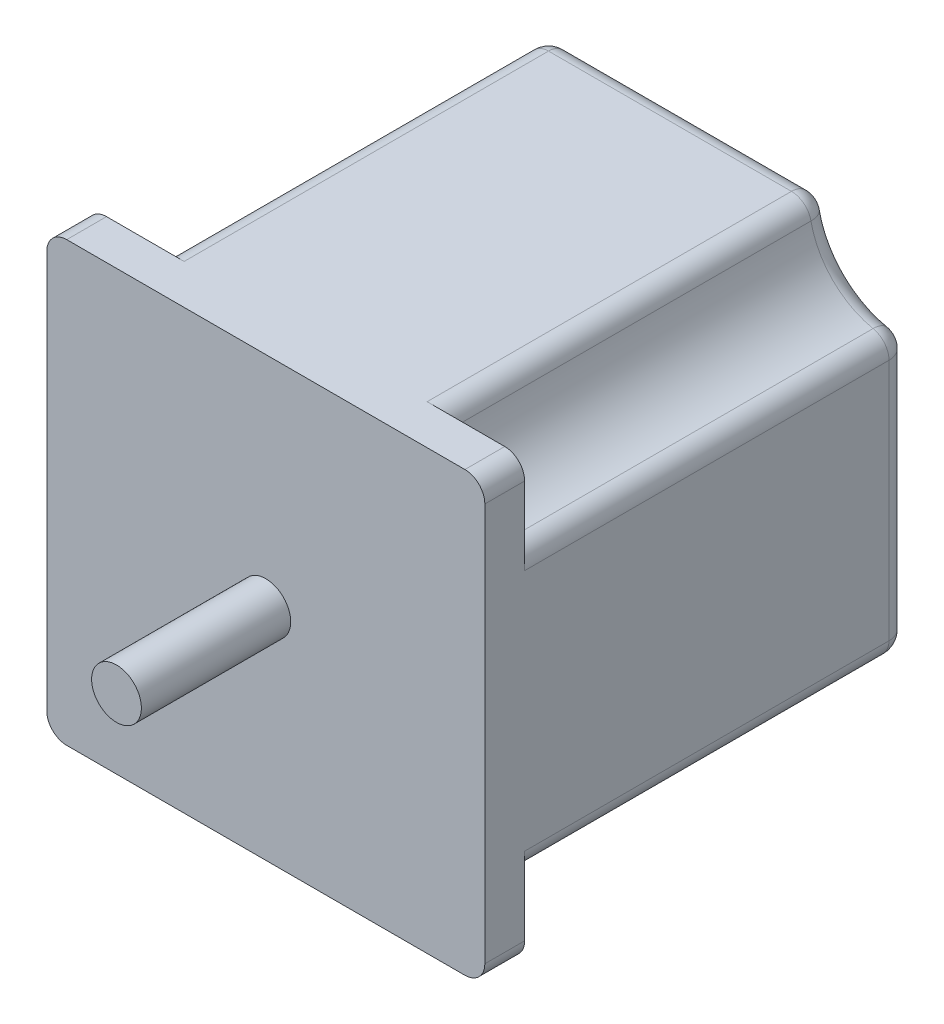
ISO-10303-21;
HEADER;
FILE_DESCRIPTION(('STEP AP214'),'2;1');
FILE_NAME('part.step','',(''),(''),'','','');
FILE_SCHEMA(('AUTOMOTIVE_DESIGN { 1 0 10303 214 1 1 1 1 }'));
ENDSEC;
DATA;
#1=APPLICATION_CONTEXT('core data for automotive mechanical design processes');
#2=APPLICATION_PROTOCOL_DEFINITION('international standard','automotive_design',2000,#1);
#3=PRODUCT_CONTEXT('',#1,'mechanical');
#4=PRODUCT('Part','Part','',(#3));
#5=PRODUCT_RELATED_PRODUCT_CATEGORY('part','',(#4));
#6=PRODUCT_DEFINITION_FORMATION('','',#4);
#7=PRODUCT_DEFINITION_CONTEXT('part definition',#1,'design');
#8=PRODUCT_DEFINITION('design','',#6,#7);
#9=PRODUCT_DEFINITION_SHAPE('','',#8);
#10=(LENGTH_UNIT() NAMED_UNIT(*) SI_UNIT(.MILLI.,.METRE.));
#11=(NAMED_UNIT(*) PLANE_ANGLE_UNIT() SI_UNIT($,.RADIAN.));
#12=(NAMED_UNIT(*) SI_UNIT($,.STERADIAN.) SOLID_ANGLE_UNIT());
#13=UNCERTAINTY_MEASURE_WITH_UNIT(LENGTH_MEASURE(1.E-05),#10,'distance_accuracy_value','');
#14=(GEOMETRIC_REPRESENTATION_CONTEXT(3) GLOBAL_UNCERTAINTY_ASSIGNED_CONTEXT((#13)) GLOBAL_UNIT_ASSIGNED_CONTEXT((#10,
#11,#12)) REPRESENTATION_CONTEXT('',''));
#15=CARTESIAN_POINT('',(0.,0.,0.));
#16=DIRECTION('',(0.,0.,1.));
#17=DIRECTION('',(1.,0.,0.));
#18=AXIS2_PLACEMENT_3D('',#15,#16,#17);
#19=CARTESIAN_POINT('',(0.,55.88,54.102));
#20=DIRECTION('',(0.,0.,-1.));
#21=DIRECTION('',(-1.,0.,0.));
#22=AXIS2_PLACEMENT_3D('',#19,#20,#21);
#23=CYLINDRICAL_SURFACE('',#22,10.16);
#24=CARTESIAN_POINT('',(0.,55.88,49.022));
#25=DIRECTION('',(0.,0.,-1.));
#26=DIRECTION('',(-1.,0.,0.));
#27=AXIS2_PLACEMENT_3D('',#24,#25,#26);
#28=CIRCLE('',#27,10.16);
#29=CARTESIAN_POINT('',(2.032,45.9252736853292,49.022));
#30=VERTEX_POINT('',#29);
#31=CARTESIAN_POINT('',(9.95472631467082,53.848,49.022));
#32=VERTEX_POINT('',#31);
#33=EDGE_CURVE('E553',#30,#32,#28,.F.);
#34=ORIENTED_EDGE('',*,*,#33,.T.);
#35=DIRECTION('',(0.,0.,-1.));
#36=VECTOR('',#35,1.);
#37=CARTESIAN_POINT('',(9.95472631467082,53.848,54.102));
#38=LINE('',#37,#36);
#39=CARTESIAN_POINT('',(9.95472631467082,53.848,2.54));
#40=VERTEX_POINT('',#39);
#41=EDGE_CURVE('E357',#32,#40,#38,.T.);
#42=ORIENTED_EDGE('',*,*,#41,.T.);
#43=CARTESIAN_POINT('',(0.,55.88,2.54));
#44=DIRECTION('',(0.,0.,-1.));
#45=DIRECTION('',(-1.,0.,0.));
#46=AXIS2_PLACEMENT_3D('',#43,#44,#45);
#47=CIRCLE('',#46,10.16);
#48=CARTESIAN_POINT('',(2.032,45.9252736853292,2.54));
#49=VERTEX_POINT('',#48);
#50=EDGE_CURVE('E354',#40,#49,#47,.T.);
#51=ORIENTED_EDGE('',*,*,#50,.T.);
#52=DIRECTION('',(0.,0.,-1.));
#53=VECTOR('',#52,1.);
#54=CARTESIAN_POINT('',(2.032,45.9252736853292,54.102));
#55=LINE('',#54,#53);
#56=EDGE_CURVE('E351',#49,#30,#55,.F.);
#57=ORIENTED_EDGE('',*,*,#56,.T.);
#58=EDGE_LOOP('',(#34,#42,#51,#57));
#59=FACE_BOUND('',#58,.T.);
#60=ADVANCED_FACE('F39',(#59),#23,.F.);
#61=CARTESIAN_POINT('',(0.,10.16,54.102));
#62=DIRECTION('',(1.,0.,0.));
#63=DIRECTION('',(0.,0.,-1.));
#64=AXIS2_PLACEMENT_3D('',#61,#62,#63);
#65=PLANE('',#64);
#66=DIRECTION('',(0.,-1.,0.));
#67=VECTOR('',#66,1.);
#68=CARTESIAN_POINT('',(0.,55.88,49.022));
#69=LINE('',#68,#67);
#70=CARTESIAN_POINT('',(0.,53.34,49.022));
#71=VERTEX_POINT('',#70);
#72=CARTESIAN_POINT('',(0.,43.4365921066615,49.022));
#73=VERTEX_POINT('',#72);
#74=EDGE_CURVE('E592',#71,#73,#69,.T.);
#75=ORIENTED_EDGE('',*,*,#74,.T.);
#76=DIRECTION('',(0.,0.,-1.));
#77=VECTOR('',#76,1.);
#78=CARTESIAN_POINT('',(0.,43.4365921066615,54.102));
#79=LINE('',#78,#77);
#80=CARTESIAN_POINT('',(0.,43.4365921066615,2.54));
#81=VERTEX_POINT('',#80);
#82=EDGE_CURVE('E348',#73,#81,#79,.T.);
#83=ORIENTED_EDGE('',*,*,#82,.T.);
#84=DIRECTION('',(0.,-1.,0.));
#85=VECTOR('',#84,1.);
#86=CARTESIAN_POINT('',(0.,10.16,2.54));
#87=LINE('',#86,#85);
#88=CARTESIAN_POINT('',(0.,12.4434078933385,2.54));
#89=VERTEX_POINT('',#88);
#90=EDGE_CURVE('E345',#81,#89,#87,.T.);
#91=ORIENTED_EDGE('',*,*,#90,.T.);
#92=DIRECTION('',(0.,0.,-1.));
#93=VECTOR('',#92,1.);
#94=CARTESIAN_POINT('',(0.,12.4434078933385,54.102));
#95=LINE('',#94,#93);
#96=CARTESIAN_POINT('',(0.,12.4434078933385,49.022));
#97=VERTEX_POINT('',#96);
#98=EDGE_CURVE('E341',#89,#97,#95,.F.);
#99=ORIENTED_EDGE('',*,*,#98,.T.);
#100=CARTESIAN_POINT('',(0.,2.54,49.022));
#101=VERTEX_POINT('',#100);
#102=EDGE_CURVE('E596',#97,#101,#69,.T.);
#103=ORIENTED_EDGE('',*,*,#102,.T.);
#104=DIRECTION('',(0.,0.,1.));
#105=VECTOR('',#104,1.);
#106=CARTESIAN_POINT('',(0.,2.54,54.102));
#107=LINE('',#106,#105);
#108=CARTESIAN_POINT('',(0.,2.54,54.102));
#109=VERTEX_POINT('',#108);
#110=EDGE_CURVE('E337',#101,#109,#107,.T.);
#111=ORIENTED_EDGE('',*,*,#110,.T.);
#112=DIRECTION('',(0.,-1.,0.));
#113=VECTOR('',#112,1.);
#114=CARTESIAN_POINT('',(0.,10.16,54.102));
#115=LINE('',#114,#113);
#116=CARTESIAN_POINT('',(0.,53.34,54.102));
#117=VERTEX_POINT('',#116);
#118=EDGE_CURVE('E559',#117,#109,#115,.T.);
#119=ORIENTED_EDGE('',*,*,#118,.F.);
#120=DIRECTION('',(0.,0.,1.));
#121=VECTOR('',#120,1.);
#122=CARTESIAN_POINT('',(0.,53.34,54.102));
#123=LINE('',#122,#121);
#124=EDGE_CURVE('E334',#117,#71,#123,.F.);
#125=ORIENTED_EDGE('',*,*,#124,.T.);
#126=EDGE_LOOP('',(#75,#83,#91,#99,#103,#111,#119,#125));
#127=FACE_BOUND('',#126,.T.);
#128=ADVANCED_FACE('F669',(#127),#65,.F.);
#129=CARTESIAN_POINT('',(0.,0.,54.102));
#130=DIRECTION('',(0.,0.,-1.));
#131=DIRECTION('',(-1.,0.,0.));
#132=AXIS2_PLACEMENT_3D('',#129,#130,#131);
#133=CYLINDRICAL_SURFACE('',#132,10.16);
#134=CARTESIAN_POINT('',(0.,0.,49.022));
#135=DIRECTION('',(0.,0.,-1.));
#136=DIRECTION('',(-1.,0.,0.));
#137=AXIS2_PLACEMENT_3D('',#134,#135,#136);
#138=CIRCLE('',#137,10.16);
#139=CARTESIAN_POINT('',(9.95472631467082,2.032,49.022));
#140=VERTEX_POINT('',#139);
#141=CARTESIAN_POINT('',(2.032,9.95472631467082,49.022));
#142=VERTEX_POINT('',#141);
#143=EDGE_CURVE('E550',#140,#142,#138,.F.);
#144=ORIENTED_EDGE('',*,*,#143,.T.);
#145=DIRECTION('',(0.,0.,-1.));
#146=VECTOR('',#145,1.);
#147=CARTESIAN_POINT('',(2.032,9.95472631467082,54.102));
#148=LINE('',#147,#146);
#149=CARTESIAN_POINT('',(2.032,9.95472631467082,2.54));
#150=VERTEX_POINT('',#149);
#151=EDGE_CURVE('E331',#142,#150,#148,.T.);
#152=ORIENTED_EDGE('',*,*,#151,.T.);
#153=CARTESIAN_POINT('',(0.,0.,2.54));
#154=DIRECTION('',(0.,0.,-1.));
#155=DIRECTION('',(-1.,0.,0.));
#156=AXIS2_PLACEMENT_3D('',#153,#154,#155);
#157=CIRCLE('',#156,10.16);
#158=CARTESIAN_POINT('',(9.95472631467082,2.032,2.54));
#159=VERTEX_POINT('',#158);
#160=EDGE_CURVE('E328',#150,#159,#157,.T.);
#161=ORIENTED_EDGE('',*,*,#160,.T.);
#162=DIRECTION('',(0.,0.,-1.));
#163=VECTOR('',#162,1.);
#164=CARTESIAN_POINT('',(9.95472631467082,2.032,54.102));
#165=LINE('',#164,#163);
#166=EDGE_CURVE('E325',#159,#140,#165,.F.);
#167=ORIENTED_EDGE('',*,*,#166,.T.);
#168=EDGE_LOOP('',(#144,#152,#161,#167));
#169=FACE_BOUND('',#168,.T.);
#170=ADVANCED_FACE('F536',(#169),#133,.F.);
#171=CARTESIAN_POINT('',(10.16,0.,54.102));
#172=DIRECTION('',(0.,1.,0.));
#173=DIRECTION('',(0.,0.,1.));
#174=AXIS2_PLACEMENT_3D('',#171,#172,#173);
#175=PLANE('',#174);
#176=DIRECTION('',(1.,0.,0.));
#177=VECTOR('',#176,1.);
#178=CARTESIAN_POINT('',(10.16,0.,54.102));
#179=LINE('',#178,#177);
#180=CARTESIAN_POINT('',(2.54,0.,54.102));
#181=VERTEX_POINT('',#180);
#182=CARTESIAN_POINT('',(53.34,0.,54.102));
#183=VERTEX_POINT('',#182);
#184=EDGE_CURVE('E569',#181,#183,#179,.T.);
#185=ORIENTED_EDGE('',*,*,#184,.F.);
#186=DIRECTION('',(0.,0.,1.));
#187=VECTOR('',#186,1.);
#188=CARTESIAN_POINT('',(2.54,0.,54.102));
#189=LINE('',#188,#187);
#190=CARTESIAN_POINT('',(2.54,0.,49.022));
#191=VERTEX_POINT('',#190);
#192=EDGE_CURVE('E322',#181,#191,#189,.F.);
#193=ORIENTED_EDGE('',*,*,#192,.T.);
#194=DIRECTION('',(1.,0.,0.));
#195=VECTOR('',#194,1.);
#196=CARTESIAN_POINT('',(55.88,0.,49.022));
#197=LINE('',#196,#195);
#198=CARTESIAN_POINT('',(12.4434078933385,0.,49.022));
#199=VERTEX_POINT('',#198);
#200=EDGE_CURVE('E548',#191,#199,#197,.T.);
#201=ORIENTED_EDGE('',*,*,#200,.T.);
#202=DIRECTION('',(0.,0.,-1.));
#203=VECTOR('',#202,1.);
#204=CARTESIAN_POINT('',(12.4434078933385,0.,54.102));
#205=LINE('',#204,#203);
#206=CARTESIAN_POINT('',(12.4434078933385,0.,2.54));
#207=VERTEX_POINT('',#206);
#208=EDGE_CURVE('E319',#199,#207,#205,.T.);
#209=ORIENTED_EDGE('',*,*,#208,.T.);
#210=DIRECTION('',(1.,0.,0.));
#211=VECTOR('',#210,1.);
#212=CARTESIAN_POINT('',(45.72,0.,2.54));
#213=LINE('',#212,#211);
#214=CARTESIAN_POINT('',(43.4365921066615,0.,2.54));
#215=VERTEX_POINT('',#214);
#216=EDGE_CURVE('E316',#207,#215,#213,.T.);
#217=ORIENTED_EDGE('',*,*,#216,.T.);
#218=DIRECTION('',(0.,0.,-1.));
#219=VECTOR('',#218,1.);
#220=CARTESIAN_POINT('',(43.4365921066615,0.,54.102));
#221=LINE('',#220,#219);
#222=CARTESIAN_POINT('',(43.4365921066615,0.,49.022));
#223=VERTEX_POINT('',#222);
#224=EDGE_CURVE('E312',#215,#223,#221,.F.);
#225=ORIENTED_EDGE('',*,*,#224,.T.);
#226=CARTESIAN_POINT('',(53.34,0.,49.022));
#227=VERTEX_POINT('',#226);
#228=EDGE_CURVE('E585',#223,#227,#197,.T.);
#229=ORIENTED_EDGE('',*,*,#228,.T.);
#230=DIRECTION('',(0.,0.,1.));
#231=VECTOR('',#230,1.);
#232=CARTESIAN_POINT('',(53.34,0.,54.102));
#233=LINE('',#232,#231);
#234=EDGE_CURVE('E308',#227,#183,#233,.T.);
#235=ORIENTED_EDGE('',*,*,#234,.T.);
#236=EDGE_LOOP('',(#185,#193,#201,#209,#217,#225,#229,#235));
#237=FACE_BOUND('',#236,.T.);
#238=ADVANCED_FACE('F588',(#237),#175,.F.);
#239=CARTESIAN_POINT('',(55.88,0.,54.102));
#240=DIRECTION('',(0.,0.,-1.));
#241=DIRECTION('',(-1.,0.,0.));
#242=AXIS2_PLACEMENT_3D('',#239,#240,#241);
#243=CYLINDRICAL_SURFACE('',#242,10.16);
#244=CARTESIAN_POINT('',(55.88,0.,49.022));
#245=DIRECTION('',(0.,0.,-1.));
#246=DIRECTION('',(-1.,0.,0.));
#247=AXIS2_PLACEMENT_3D('',#244,#245,#246);
#248=CIRCLE('',#247,10.16);
#249=CARTESIAN_POINT('',(53.848,9.95472631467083,49.022));
#250=VERTEX_POINT('',#249);
#251=CARTESIAN_POINT('',(45.9252736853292,2.032,49.022));
#252=VERTEX_POINT('',#251);
#253=EDGE_CURVE('E554',#250,#252,#248,.F.);
#254=ORIENTED_EDGE('',*,*,#253,.T.);
#255=DIRECTION('',(0.,0.,-1.));
#256=VECTOR('',#255,1.);
#257=CARTESIAN_POINT('',(45.9252736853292,2.032,54.102));
#258=LINE('',#257,#256);
#259=CARTESIAN_POINT('',(45.9252736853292,2.032,2.54));
#260=VERTEX_POINT('',#259);
#261=EDGE_CURVE('E305',#252,#260,#258,.T.);
#262=ORIENTED_EDGE('',*,*,#261,.T.);
#263=CARTESIAN_POINT('',(55.88,0.,2.54));
#264=DIRECTION('',(0.,0.,-1.));
#265=DIRECTION('',(-1.,0.,0.));
#266=AXIS2_PLACEMENT_3D('',#263,#264,#265);
#267=CIRCLE('',#266,10.16);
#268=CARTESIAN_POINT('',(53.848,9.95472631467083,2.54));
#269=VERTEX_POINT('',#268);
#270=EDGE_CURVE('E302',#260,#269,#267,.T.);
#271=ORIENTED_EDGE('',*,*,#270,.T.);
#272=DIRECTION('',(0.,0.,-1.));
#273=VECTOR('',#272,1.);
#274=CARTESIAN_POINT('',(53.848,9.95472631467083,54.102));
#275=LINE('',#274,#273);
#276=EDGE_CURVE('E299',#269,#250,#275,.F.);
#277=ORIENTED_EDGE('',*,*,#276,.T.);
#278=EDGE_LOOP('',(#254,#262,#271,#277));
#279=FACE_BOUND('',#278,.T.);
#280=ADVANCED_FACE('F970',(#279),#243,.F.);
#281=CARTESIAN_POINT('',(55.88,10.16,54.102));
#282=DIRECTION('',(-1.,0.,0.));
#283=DIRECTION('',(0.,0.,1.));
#284=AXIS2_PLACEMENT_3D('',#281,#282,#283);
#285=PLANE('',#284);
#286=DIRECTION('',(0.,1.,0.));
#287=VECTOR('',#286,1.);
#288=CARTESIAN_POINT('',(55.88,10.16,54.102));
#289=LINE('',#288,#287);
#290=CARTESIAN_POINT('',(55.88,2.54,54.102));
#291=VERTEX_POINT('',#290);
#292=CARTESIAN_POINT('',(55.88,53.34,54.102));
#293=VERTEX_POINT('',#292);
#294=EDGE_CURVE('E262',#291,#293,#289,.T.);
#295=ORIENTED_EDGE('',*,*,#294,.F.);
#296=DIRECTION('',(0.,0.,1.));
#297=VECTOR('',#296,1.);
#298=CARTESIAN_POINT('',(55.88,2.54,54.102));
#299=LINE('',#298,#297);
#300=CARTESIAN_POINT('',(55.88,2.54,49.022));
#301=VERTEX_POINT('',#300);
#302=EDGE_CURVE('E271',#291,#301,#299,.F.);
#303=ORIENTED_EDGE('',*,*,#302,.T.);
#304=DIRECTION('',(0.,1.,0.));
#305=VECTOR('',#304,1.);
#306=CARTESIAN_POINT('',(55.88,55.88,49.022));
#307=LINE('',#306,#305);
#308=CARTESIAN_POINT('',(55.88,12.4434078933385,49.022));
#309=VERTEX_POINT('',#308);
#310=EDGE_CURVE('E250',#301,#309,#307,.T.);
#311=ORIENTED_EDGE('',*,*,#310,.T.);
#312=DIRECTION('',(0.,0.,-1.));
#313=VECTOR('',#312,1.);
#314=CARTESIAN_POINT('',(55.88,12.4434078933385,54.102));
#315=LINE('',#314,#313);
#316=CARTESIAN_POINT('',(55.88,12.4434078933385,2.54));
#317=VERTEX_POINT('',#316);
#318=EDGE_CURVE('E268',#309,#317,#315,.T.);
#319=ORIENTED_EDGE('',*,*,#318,.T.);
#320=DIRECTION('',(0.,1.,0.));
#321=VECTOR('',#320,1.);
#322=CARTESIAN_POINT('',(55.88,45.72,2.54));
#323=LINE('',#322,#321);
#324=CARTESIAN_POINT('',(55.88,43.4365921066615,2.54));
#325=VERTEX_POINT('',#324);
#326=EDGE_CURVE('E259',#317,#325,#323,.T.);
#327=ORIENTED_EDGE('',*,*,#326,.T.);
#328=DIRECTION('',(0.,0.,-1.));
#329=VECTOR('',#328,1.);
#330=CARTESIAN_POINT('',(55.88,43.4365921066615,54.102));
#331=LINE('',#330,#329);
#332=CARTESIAN_POINT('',(55.88,43.4365921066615,49.022));
#333=VERTEX_POINT('',#332);
#334=EDGE_CURVE('E247',#325,#333,#331,.F.);
#335=ORIENTED_EDGE('',*,*,#334,.T.);
#336=CARTESIAN_POINT('',(55.88,53.34,49.022));
#337=VERTEX_POINT('',#336);
#338=EDGE_CURVE('E228',#333,#337,#307,.T.);
#339=ORIENTED_EDGE('',*,*,#338,.T.);
#340=DIRECTION('',(0.,0.,1.));
#341=VECTOR('',#340,1.);
#342=CARTESIAN_POINT('',(55.88,53.34,54.102));
#343=LINE('',#342,#341);
#344=EDGE_CURVE('E243',#337,#293,#343,.T.);
#345=ORIENTED_EDGE('',*,*,#344,.T.);
#346=EDGE_LOOP('',(#295,#303,#311,#319,#327,#335,#339,#345));
#347=FACE_BOUND('',#346,.T.);
#348=ADVANCED_FACE('F242',(#347),#285,.F.);
#349=CARTESIAN_POINT('',(55.88,55.88,54.102));
#350=DIRECTION('',(0.,0.,-1.));
#351=DIRECTION('',(-1.,0.,0.));
#352=AXIS2_PLACEMENT_3D('',#349,#350,#351);
#353=CYLINDRICAL_SURFACE('',#352,10.16);
#354=CARTESIAN_POINT('',(55.88,55.88,49.022));
#355=DIRECTION('',(0.,0.,-1.));
#356=DIRECTION('',(-1.,0.,0.));
#357=AXIS2_PLACEMENT_3D('',#354,#355,#356);
#358=CIRCLE('',#357,10.16);
#359=CARTESIAN_POINT('',(45.9252736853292,53.848,49.022));
#360=VERTEX_POINT('',#359);
#361=CARTESIAN_POINT('',(53.848,45.9252736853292,49.022));
#362=VERTEX_POINT('',#361);
#363=EDGE_CURVE('E562',#360,#362,#358,.F.);
#364=ORIENTED_EDGE('',*,*,#363,.T.);
#365=DIRECTION('',(0.,0.,-1.));
#366=VECTOR('',#365,1.);
#367=CARTESIAN_POINT('',(53.848,45.9252736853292,54.102));
#368=LINE('',#367,#366);
#369=CARTESIAN_POINT('',(53.848,45.9252736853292,2.54));
#370=VERTEX_POINT('',#369);
#371=EDGE_CURVE('E366',#362,#370,#368,.T.);
#372=ORIENTED_EDGE('',*,*,#371,.T.);
#373=CARTESIAN_POINT('',(55.88,55.88,2.54));
#374=DIRECTION('',(0.,0.,-1.));
#375=DIRECTION('',(-1.,0.,0.));
#376=AXIS2_PLACEMENT_3D('',#373,#374,#375);
#377=CIRCLE('',#376,10.16);
#378=CARTESIAN_POINT('',(45.9252736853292,53.848,2.54));
#379=VERTEX_POINT('',#378);
#380=EDGE_CURVE('E363',#370,#379,#377,.T.);
#381=ORIENTED_EDGE('',*,*,#380,.T.);
#382=DIRECTION('',(0.,0.,-1.));
#383=VECTOR('',#382,1.);
#384=CARTESIAN_POINT('',(45.9252736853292,53.848,54.102));
#385=LINE('',#384,#383);
#386=EDGE_CURVE('E360',#379,#360,#385,.F.);
#387=ORIENTED_EDGE('',*,*,#386,.T.);
#388=EDGE_LOOP('',(#364,#372,#381,#387));
#389=FACE_BOUND('',#388,.T.);
#390=ADVANCED_FACE('F604',(#389),#353,.F.);
#391=CARTESIAN_POINT('',(10.16,55.88,54.102));
#392=DIRECTION('',(0.,-1.,0.));
#393=DIRECTION('',(0.,0.,-1.));
#394=AXIS2_PLACEMENT_3D('',#391,#392,#393);
#395=PLANE('',#394);
#396=DIRECTION('',(-1.,0.,0.));
#397=VECTOR('',#396,1.);
#398=CARTESIAN_POINT('',(55.88,55.88,49.022));
#399=LINE('',#398,#397);
#400=CARTESIAN_POINT('',(12.4434078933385,55.88,49.022));
#401=VERTEX_POINT('',#400);
#402=CARTESIAN_POINT('',(2.54,55.88,49.022));
#403=VERTEX_POINT('',#402);
#404=EDGE_CURVE('E55',#401,#403,#399,.T.);
#405=ORIENTED_EDGE('',*,*,#404,.T.);
#406=DIRECTION('',(0.,0.,1.));
#407=VECTOR('',#406,1.);
#408=CARTESIAN_POINT('',(2.54,55.88,54.102));
#409=LINE('',#408,#407);
#410=CARTESIAN_POINT('',(2.54,55.88,54.102));
#411=VERTEX_POINT('',#410);
#412=EDGE_CURVE('E380',#403,#411,#409,.T.);
#413=ORIENTED_EDGE('',*,*,#412,.T.);
#414=DIRECTION('',(-1.,0.,0.));
#415=VECTOR('',#414,1.);
#416=CARTESIAN_POINT('',(10.16,55.88,54.102));
#417=LINE('',#416,#415);
#418=CARTESIAN_POINT('',(53.34,55.88,54.102));
#419=VERTEX_POINT('',#418);
#420=EDGE_CURVE('E255',#419,#411,#417,.T.);
#421=ORIENTED_EDGE('',*,*,#420,.F.);
#422=DIRECTION('',(0.,0.,1.));
#423=VECTOR('',#422,1.);
#424=CARTESIAN_POINT('',(53.34,55.88,54.102));
#425=LINE('',#424,#423);
#426=CARTESIAN_POINT('',(53.34,55.88,49.022));
#427=VERTEX_POINT('',#426);
#428=EDGE_CURVE('E369',#419,#427,#425,.F.);
#429=ORIENTED_EDGE('',*,*,#428,.T.);
#430=CARTESIAN_POINT('',(43.4365921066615,55.88,49.022));
#431=VERTEX_POINT('',#430);
#432=EDGE_CURVE('E231',#427,#431,#399,.T.);
#433=ORIENTED_EDGE('',*,*,#432,.T.);
#434=DIRECTION('',(0.,0.,-1.));
#435=VECTOR('',#434,1.);
#436=CARTESIAN_POINT('',(43.4365921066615,55.88,54.102));
#437=LINE('',#436,#435);
#438=CARTESIAN_POINT('',(43.4365921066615,55.88,2.54));
#439=VERTEX_POINT('',#438);
#440=EDGE_CURVE('E372',#431,#439,#437,.T.);
#441=ORIENTED_EDGE('',*,*,#440,.T.);
#442=DIRECTION('',(-1.,0.,0.));
#443=VECTOR('',#442,1.);
#444=CARTESIAN_POINT('',(10.16,55.88,2.54));
#445=LINE('',#444,#443);
#446=CARTESIAN_POINT('',(12.4434078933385,55.88,2.54));
#447=VERTEX_POINT('',#446);
#448=EDGE_CURVE('E62',#439,#447,#445,.T.);
#449=ORIENTED_EDGE('',*,*,#448,.T.);
#450=DIRECTION('',(0.,0.,-1.));
#451=VECTOR('',#450,1.);
#452=CARTESIAN_POINT('',(12.4434078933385,55.88,54.102));
#453=LINE('',#452,#451);
#454=EDGE_CURVE('E377',#447,#401,#453,.F.);
#455=ORIENTED_EDGE('',*,*,#454,.T.);
#456=EDGE_LOOP('',(#405,#413,#421,#429,#433,#441,#449,#455));
#457=FACE_BOUND('',#456,.T.);
#458=ADVANCED_FACE('F640',(#457),#395,.F.);
#459=CARTESIAN_POINT('',(0.,55.88,54.102));
#460=DIRECTION('',(0.,0.,-1.));
#461=DIRECTION('',(-1.,0.,0.));
#462=AXIS2_PLACEMENT_3D('',#459,#460,#461);
#463=PLANE('',#462);
#464=CARTESIAN_POINT('',(27.94,27.94,54.102));
#465=DIRECTION('',(0.,0.,-1.));
#466=DIRECTION('',(-1.,0.,0.));
#467=AXIS2_PLACEMENT_3D('',#464,#465,#466);
#468=CIRCLE('',#467,3.175);
#469=CARTESIAN_POINT('',(24.765,27.94,54.102));
#470=VERTEX_POINT('',#469);
#471=EDGE_CURVE('E11',#470,#470,#468,.F.);
#472=ORIENTED_EDGE('',*,*,#471,.F.);
#473=EDGE_LOOP('',(#472));
#474=FACE_BOUND('',#473,.T.);
#475=ORIENTED_EDGE('',*,*,#118,.T.);
#476=CARTESIAN_POINT('',(2.54,2.54,54.102));
#477=DIRECTION('',(0.,0.,-1.));
#478=DIRECTION('',(-1.,0.,0.));
#479=AXIS2_PLACEMENT_3D('',#476,#477,#478);
#480=CIRCLE('',#479,2.54);
#481=EDGE_CURVE('E392',#109,#181,#480,.F.);
#482=ORIENTED_EDGE('',*,*,#481,.T.);
#483=ORIENTED_EDGE('',*,*,#184,.T.);
#484=CARTESIAN_POINT('',(53.34,2.54,54.102));
#485=DIRECTION('',(0.,0.,-1.));
#486=DIRECTION('',(-1.,0.,0.));
#487=AXIS2_PLACEMENT_3D('',#484,#485,#486);
#488=CIRCLE('',#487,2.54);
#489=EDGE_CURVE('E386',#183,#291,#488,.F.);
#490=ORIENTED_EDGE('',*,*,#489,.T.);
#491=ORIENTED_EDGE('',*,*,#294,.T.);
#492=CARTESIAN_POINT('',(53.34,53.34,54.102));
#493=DIRECTION('',(0.,0.,-1.));
#494=DIRECTION('',(-1.,0.,0.));
#495=AXIS2_PLACEMENT_3D('',#492,#493,#494);
#496=CIRCLE('',#495,2.54);
#497=EDGE_CURVE('E253',#293,#419,#496,.F.);
#498=ORIENTED_EDGE('',*,*,#497,.T.);
#499=ORIENTED_EDGE('',*,*,#420,.T.);
#500=CARTESIAN_POINT('',(2.54,53.34,54.102));
#501=DIRECTION('',(0.,0.,-1.));
#502=DIRECTION('',(-1.,0.,0.));
#503=AXIS2_PLACEMENT_3D('',#500,#501,#502);
#504=CIRCLE('',#503,2.54);
#505=EDGE_CURVE('E389',#411,#117,#504,.F.);
#506=ORIENTED_EDGE('',*,*,#505,.T.);
#507=EDGE_LOOP('',(#475,#482,#483,#490,#491,#498,#499,#506));
#508=FACE_BOUND('',#507,.T.);
#509=ADVANCED_FACE('F574',(#474,#508),#463,.F.);
#510=CARTESIAN_POINT('',(0.,55.88,0.));
#511=DIRECTION('',(0.,0.,-1.));
#512=DIRECTION('',(-1.,0.,0.));
#513=AXIS2_PLACEMENT_3D('',#510,#511,#512);
#514=PLANE('',#513);
#515=CARTESIAN_POINT('',(55.88,55.88,0.));
#516=DIRECTION('',(0.,0.,-1.));
#517=DIRECTION('',(-1.,0.,0.));
#518=AXIS2_PLACEMENT_3D('',#515,#516,#517);
#519=CIRCLE('',#518,12.7);
#520=CARTESIAN_POINT('',(43.4365921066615,53.34,0.));
#521=VERTEX_POINT('',#520);
#522=CARTESIAN_POINT('',(53.34,43.4365921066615,0.));
#523=VERTEX_POINT('',#522);
#524=EDGE_CURVE('E277',#521,#523,#519,.F.);
#525=ORIENTED_EDGE('',*,*,#524,.T.);
#526=DIRECTION('',(0.,1.,0.));
#527=VECTOR('',#526,1.);
#528=CARTESIAN_POINT('',(53.34,10.16,0.));
#529=LINE('',#528,#527);
#530=CARTESIAN_POINT('',(53.34,12.4434078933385,0.));
#531=VERTEX_POINT('',#530);
#532=EDGE_CURVE('E295',#523,#531,#529,.F.);
#533=ORIENTED_EDGE('',*,*,#532,.T.);
#534=CARTESIAN_POINT('',(55.88,0.,0.));
#535=DIRECTION('',(0.,0.,-1.));
#536=DIRECTION('',(-1.,0.,0.));
#537=AXIS2_PLACEMENT_3D('',#534,#535,#536);
#538=CIRCLE('',#537,12.7);
#539=CARTESIAN_POINT('',(43.4365921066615,2.54,0.));
#540=VERTEX_POINT('',#539);
#541=EDGE_CURVE('E292',#531,#540,#538,.F.);
#542=ORIENTED_EDGE('',*,*,#541,.T.);
#543=DIRECTION('',(1.,0.,0.));
#544=VECTOR('',#543,1.);
#545=CARTESIAN_POINT('',(10.16,2.54,0.));
#546=LINE('',#545,#544);
#547=CARTESIAN_POINT('',(12.4434078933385,2.54,0.));
#548=VERTEX_POINT('',#547);
#549=EDGE_CURVE('E289',#540,#548,#546,.F.);
#550=ORIENTED_EDGE('',*,*,#549,.T.);
#551=CARTESIAN_POINT('',(0.,0.,0.));
#552=DIRECTION('',(0.,0.,-1.));
#553=DIRECTION('',(-1.,0.,0.));
#554=AXIS2_PLACEMENT_3D('',#551,#552,#553);
#555=CIRCLE('',#554,12.7);
#556=CARTESIAN_POINT('',(2.54,12.4434078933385,0.));
#557=VERTEX_POINT('',#556);
#558=EDGE_CURVE('E286',#548,#557,#555,.F.);
#559=ORIENTED_EDGE('',*,*,#558,.T.);
#560=DIRECTION('',(0.,-1.,0.));
#561=VECTOR('',#560,1.);
#562=CARTESIAN_POINT('',(2.54,45.72,0.));
#563=LINE('',#562,#561);
#564=CARTESIAN_POINT('',(2.54,43.4365921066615,0.));
#565=VERTEX_POINT('',#564);
#566=EDGE_CURVE('E283',#557,#565,#563,.F.);
#567=ORIENTED_EDGE('',*,*,#566,.T.);
#568=CARTESIAN_POINT('',(0.,55.88,0.));
#569=DIRECTION('',(0.,0.,-1.));
#570=DIRECTION('',(-1.,0.,0.));
#571=AXIS2_PLACEMENT_3D('',#568,#569,#570);
#572=CIRCLE('',#571,12.7);
#573=CARTESIAN_POINT('',(12.4434078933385,53.34,0.));
#574=VERTEX_POINT('',#573);
#575=EDGE_CURVE('E280',#565,#574,#572,.F.);
#576=ORIENTED_EDGE('',*,*,#575,.T.);
#577=DIRECTION('',(-1.,0.,0.));
#578=VECTOR('',#577,1.);
#579=CARTESIAN_POINT('',(45.72,53.34,0.));
#580=LINE('',#579,#578);
#581=EDGE_CURVE('E274',#574,#521,#580,.F.);
#582=ORIENTED_EDGE('',*,*,#581,.T.);
#583=EDGE_LOOP('',(#525,#533,#542,#550,#559,#567,#576,#582));
#584=FACE_BOUND('',#583,.T.);
#585=ADVANCED_FACE('F624',(#584),#514,.T.);
#586=CARTESIAN_POINT('',(0.,0.,49.022));
#587=DIRECTION('',(0.,0.,-1.));
#588=DIRECTION('',(-1.,0.,0.));
#589=AXIS2_PLACEMENT_3D('',#586,#587,#588);
#590=PLANE('',#589);
#591=ORIENTED_EDGE('',*,*,#432,.F.);
#592=CARTESIAN_POINT('',(53.34,53.34,49.022));
#593=DIRECTION('',(0.,0.,-1.));
#594=DIRECTION('',(-1.,0.,0.));
#595=AXIS2_PLACEMENT_3D('',#592,#593,#594);
#596=CIRCLE('',#595,2.54);
#597=EDGE_CURVE('E225',#427,#337,#596,.T.);
#598=ORIENTED_EDGE('',*,*,#597,.T.);
#599=ORIENTED_EDGE('',*,*,#338,.F.);
#600=CARTESIAN_POINT('',(53.34,43.4365921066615,49.022));
#601=DIRECTION('',(0.,0.,-1.));
#602=DIRECTION('',(-1.,0.,0.));
#603=AXIS2_PLACEMENT_3D('',#600,#601,#602);
#604=CIRCLE('',#603,2.54);
#605=EDGE_CURVE('E423',#333,#362,#604,.F.);
#606=ORIENTED_EDGE('',*,*,#605,.T.);
#607=ORIENTED_EDGE('',*,*,#363,.F.);
#608=CARTESIAN_POINT('',(43.4365921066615,53.34,49.022));
#609=DIRECTION('',(0.,0.,-1.));
#610=DIRECTION('',(-1.,0.,0.));
#611=AXIS2_PLACEMENT_3D('',#608,#609,#610);
#612=CIRCLE('',#611,2.54);
#613=EDGE_CURVE('E48',#360,#431,#612,.F.);
#614=ORIENTED_EDGE('',*,*,#613,.T.);
#615=EDGE_LOOP('',(#591,#598,#599,#606,#607,#614));
#616=FACE_BOUND('',#615,.T.);
#617=ADVANCED_FACE('F227',(#616),#590,.T.);
#618=ORIENTED_EDGE('',*,*,#310,.F.);
#619=CARTESIAN_POINT('',(53.34,2.54,49.022));
#620=DIRECTION('',(0.,0.,-1.));
#621=DIRECTION('',(-1.,0.,0.));
#622=AXIS2_PLACEMENT_3D('',#619,#620,#621);
#623=CIRCLE('',#622,2.54);
#624=EDGE_CURVE('E237',#301,#227,#623,.T.);
#625=ORIENTED_EDGE('',*,*,#624,.T.);
#626=ORIENTED_EDGE('',*,*,#228,.F.);
#627=CARTESIAN_POINT('',(43.4365921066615,2.54,49.022));
#628=DIRECTION('',(0.,0.,-1.));
#629=DIRECTION('',(-1.,0.,0.));
#630=AXIS2_PLACEMENT_3D('',#627,#628,#629);
#631=CIRCLE('',#630,2.54);
#632=EDGE_CURVE('E416',#223,#252,#631,.F.);
#633=ORIENTED_EDGE('',*,*,#632,.T.);
#634=ORIENTED_EDGE('',*,*,#253,.F.);
#635=CARTESIAN_POINT('',(53.34,12.4434078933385,49.022));
#636=DIRECTION('',(0.,0.,-1.));
#637=DIRECTION('',(-1.,0.,0.));
#638=AXIS2_PLACEMENT_3D('',#635,#636,#637);
#639=CIRCLE('',#638,2.54);
#640=EDGE_CURVE('E419',#250,#309,#639,.F.);
#641=ORIENTED_EDGE('',*,*,#640,.T.);
#642=EDGE_LOOP('',(#618,#625,#626,#633,#634,#641));
#643=FACE_BOUND('',#642,.T.);
#644=ADVANCED_FACE('F584',(#643),#590,.T.);
#645=ORIENTED_EDGE('',*,*,#200,.F.);
#646=CARTESIAN_POINT('',(2.54,2.54,49.022));
#647=DIRECTION('',(0.,0.,-1.));
#648=DIRECTION('',(-1.,0.,0.));
#649=AXIS2_PLACEMENT_3D('',#646,#647,#648);
#650=CIRCLE('',#649,2.54);
#651=EDGE_CURVE('E395',#191,#101,#650,.T.);
#652=ORIENTED_EDGE('',*,*,#651,.T.);
#653=ORIENTED_EDGE('',*,*,#102,.F.);
#654=CARTESIAN_POINT('',(2.54,12.4434078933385,49.022));
#655=DIRECTION('',(0.,0.,-1.));
#656=DIRECTION('',(-1.,0.,0.));
#657=AXIS2_PLACEMENT_3D('',#654,#655,#656);
#658=CIRCLE('',#657,2.54);
#659=EDGE_CURVE('E409',#97,#142,#658,.F.);
#660=ORIENTED_EDGE('',*,*,#659,.T.);
#661=ORIENTED_EDGE('',*,*,#143,.F.);
#662=CARTESIAN_POINT('',(12.4434078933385,2.54,49.022));
#663=DIRECTION('',(0.,0.,-1.));
#664=DIRECTION('',(-1.,0.,0.));
#665=AXIS2_PLACEMENT_3D('',#662,#663,#664);
#666=CIRCLE('',#665,2.54);
#667=EDGE_CURVE('E412',#140,#199,#666,.F.);
#668=ORIENTED_EDGE('',*,*,#667,.T.);
#669=EDGE_LOOP('',(#645,#652,#653,#660,#661,#668));
#670=FACE_BOUND('',#669,.T.);
#671=ADVANCED_FACE('F547',(#670),#590,.T.);
#672=ORIENTED_EDGE('',*,*,#74,.F.);
#673=CARTESIAN_POINT('',(2.54,53.34,49.022));
#674=DIRECTION('',(0.,0.,-1.));
#675=DIRECTION('',(-1.,0.,0.));
#676=AXIS2_PLACEMENT_3D('',#673,#674,#675);
#677=CIRCLE('',#676,2.54);
#678=EDGE_CURVE('E398',#71,#403,#677,.T.);
#679=ORIENTED_EDGE('',*,*,#678,.T.);
#680=ORIENTED_EDGE('',*,*,#404,.F.);
#681=CARTESIAN_POINT('',(12.4434078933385,53.34,49.022));
#682=DIRECTION('',(0.,0.,-1.));
#683=DIRECTION('',(-1.,0.,0.));
#684=AXIS2_PLACEMENT_3D('',#681,#682,#683);
#685=CIRCLE('',#684,2.54);
#686=EDGE_CURVE('E236',#401,#32,#685,.F.);
#687=ORIENTED_EDGE('',*,*,#686,.T.);
#688=ORIENTED_EDGE('',*,*,#33,.F.);
#689=CARTESIAN_POINT('',(2.54,43.4365921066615,49.022));
#690=DIRECTION('',(0.,0.,-1.));
#691=DIRECTION('',(-1.,0.,0.));
#692=AXIS2_PLACEMENT_3D('',#689,#690,#691);
#693=CIRCLE('',#692,2.54);
#694=EDGE_CURVE('E405',#30,#73,#693,.F.);
#695=ORIENTED_EDGE('',*,*,#694,.T.);
#696=EDGE_LOOP('',(#672,#679,#680,#687,#688,#695));
#697=FACE_BOUND('',#696,.T.);
#698=ADVANCED_FACE('F754',(#697),#590,.T.);
#699=CARTESIAN_POINT('',(2.54,12.4434078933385,54.102));
#700=DIRECTION('',(0.,0.,-1.));
#701=DIRECTION('',(-1.,0.,0.));
#702=AXIS2_PLACEMENT_3D('',#699,#700,#701);
#703=CYLINDRICAL_SURFACE('',#702,2.54);
#704=ORIENTED_EDGE('',*,*,#659,.F.);
#705=ORIENTED_EDGE('',*,*,#98,.F.);
#706=CARTESIAN_POINT('',(2.54,12.4434078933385,2.54));
#707=DIRECTION('',(0.,0.,-1.));
#708=DIRECTION('',(-1.,0.,0.));
#709=AXIS2_PLACEMENT_3D('',#706,#707,#708);
#710=CIRCLE('',#709,2.54);
#711=EDGE_CURVE('E515',#150,#89,#710,.T.);
#712=ORIENTED_EDGE('',*,*,#711,.F.);
#713=ORIENTED_EDGE('',*,*,#151,.F.);
#714=EDGE_LOOP('',(#704,#705,#712,#713));
#715=FACE_BOUND('',#714,.T.);
#716=ADVANCED_FACE('F750',(#715),#703,.T.);
#717=CARTESIAN_POINT('',(2.54,43.4365921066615,54.102));
#718=DIRECTION('',(0.,0.,-1.));
#719=DIRECTION('',(-1.,0.,0.));
#720=AXIS2_PLACEMENT_3D('',#717,#718,#719);
#721=CYLINDRICAL_SURFACE('',#720,2.54);
#722=ORIENTED_EDGE('',*,*,#694,.F.);
#723=ORIENTED_EDGE('',*,*,#56,.F.);
#724=CARTESIAN_POINT('',(2.54,43.4365921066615,2.54));
#725=DIRECTION('',(0.,0.,-1.));
#726=DIRECTION('',(-1.,0.,0.));
#727=AXIS2_PLACEMENT_3D('',#724,#725,#726);
#728=CIRCLE('',#727,2.54);
#729=EDGE_CURVE('E511',#81,#49,#728,.T.);
#730=ORIENTED_EDGE('',*,*,#729,.F.);
#731=ORIENTED_EDGE('',*,*,#82,.F.);
#732=EDGE_LOOP('',(#722,#723,#730,#731));
#733=FACE_BOUND('',#732,.T.);
#734=ADVANCED_FACE('F747',(#733),#721,.T.);
#735=CARTESIAN_POINT('',(2.54,10.16,2.54));
#736=DIRECTION('',(0.,1.,0.));
#737=DIRECTION('',(0.,0.,1.));
#738=AXIS2_PLACEMENT_3D('',#735,#736,#737);
#739=CYLINDRICAL_SURFACE('',#738,2.54);
#740=CARTESIAN_POINT('',(2.54,12.4434078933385,2.54));
#741=DIRECTION('',(0.,-1.,0.));
#742=DIRECTION('',(0.,0.,-1.));
#743=AXIS2_PLACEMENT_3D('',#740,#741,#742);
#744=CIRCLE('',#743,2.54);
#745=EDGE_CURVE('E251',#89,#557,#744,.T.);
#746=ORIENTED_EDGE('',*,*,#745,.F.);
#747=ORIENTED_EDGE('',*,*,#90,.F.);
#748=CARTESIAN_POINT('',(2.54,43.4365921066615,2.54));
#749=DIRECTION('',(0.,1.,0.));
#750=DIRECTION('',(0.,0.,1.));
#751=AXIS2_PLACEMENT_3D('',#748,#749,#750);
#752=CIRCLE('',#751,2.54);
#753=EDGE_CURVE('E507',#565,#81,#752,.T.);
#754=ORIENTED_EDGE('',*,*,#753,.F.);
#755=ORIENTED_EDGE('',*,*,#566,.F.);
#756=EDGE_LOOP('',(#746,#747,#754,#755));
#757=FACE_BOUND('',#756,.T.);
#758=ADVANCED_FACE('F744',(#757),#739,.T.);
#759=CARTESIAN_POINT('',(2.54,12.4434078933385,2.54));
#760=DIRECTION('',(0.,0.,1.));
#761=DIRECTION('',(1.,0.,0.));
#762=AXIS2_PLACEMENT_3D('',#759,#760,#761);
#763=SPHERICAL_SURFACE('',#762,2.54);
#764=ORIENTED_EDGE('',*,*,#711,.T.);
#765=ORIENTED_EDGE('',*,*,#745,.T.);
#766=CARTESIAN_POINT('',(2.54,12.4434078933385,2.54));
#767=DIRECTION('',(-0.979795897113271,0.2,0.));
#768=DIRECTION('',(-0.2,-0.979795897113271,0.));
#769=AXIS2_PLACEMENT_3D('',#766,#767,#768);
#770=CIRCLE('',#769,2.54);
#771=EDGE_CURVE('E503',#150,#557,#770,.F.);
#772=ORIENTED_EDGE('',*,*,#771,.F.);
#773=EDGE_LOOP('',(#764,#765,#772));
#774=FACE_BOUND('',#773,.T.);
#775=ADVANCED_FACE('F523',(#774),#763,.T.);
#776=CARTESIAN_POINT('',(2.54,43.4365921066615,2.54));
#777=DIRECTION('',(0.,0.,1.));
#778=DIRECTION('',(1.,0.,0.));
#779=AXIS2_PLACEMENT_3D('',#776,#777,#778);
#780=SPHERICAL_SURFACE('',#779,2.54);
#781=ORIENTED_EDGE('',*,*,#753,.T.);
#782=ORIENTED_EDGE('',*,*,#729,.T.);
#783=CARTESIAN_POINT('',(2.54,43.4365921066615,2.54));
#784=DIRECTION('',(-0.979795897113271,-0.2,0.));
#785=DIRECTION('',(0.2,-0.979795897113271,0.));
#786=AXIS2_PLACEMENT_3D('',#783,#784,#785);
#787=CIRCLE('',#786,2.54);
#788=EDGE_CURVE('E499',#565,#49,#787,.F.);
#789=ORIENTED_EDGE('',*,*,#788,.F.);
#790=EDGE_LOOP('',(#781,#782,#789));
#791=FACE_BOUND('',#790,.T.);
#792=ADVANCED_FACE('F738',(#791),#780,.T.);
#793=CARTESIAN_POINT('',(0.,0.,2.54));
#794=DIRECTION('',(0.,0.,-1.));
#795=DIRECTION('',(-1.,0.,0.));
#796=AXIS2_PLACEMENT_3D('',#793,#794,#795);
#797=TOROIDAL_SURFACE('',#796,12.7,2.54);
#798=ORIENTED_EDGE('',*,*,#771,.T.);
#799=ORIENTED_EDGE('',*,*,#558,.F.);
#800=CARTESIAN_POINT('',(12.4434078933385,2.54,2.54));
#801=DIRECTION('',(0.2,-0.979795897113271,0.));
#802=DIRECTION('',(0.979795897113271,0.2,0.));
#803=AXIS2_PLACEMENT_3D('',#800,#801,#802);
#804=CIRCLE('',#803,2.54);
#805=EDGE_CURVE('E495',#159,#548,#804,.T.);
#806=ORIENTED_EDGE('',*,*,#805,.F.);
#807=ORIENTED_EDGE('',*,*,#160,.F.);
#808=EDGE_LOOP('',(#798,#799,#806,#807));
#809=FACE_BOUND('',#808,.T.);
#810=ADVANCED_FACE('F531',(#809),#797,.T.);
#811=CARTESIAN_POINT('',(12.4434078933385,2.54,54.102));
#812=DIRECTION('',(0.,0.,-1.));
#813=DIRECTION('',(-1.,0.,0.));
#814=AXIS2_PLACEMENT_3D('',#811,#812,#813);
#815=CYLINDRICAL_SURFACE('',#814,2.54);
#816=ORIENTED_EDGE('',*,*,#667,.F.);
#817=ORIENTED_EDGE('',*,*,#166,.F.);
#818=CARTESIAN_POINT('',(12.4434078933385,2.54,2.54));
#819=DIRECTION('',(0.,0.,-1.));
#820=DIRECTION('',(-1.,0.,0.));
#821=AXIS2_PLACEMENT_3D('',#818,#819,#820);
#822=CIRCLE('',#821,2.54);
#823=EDGE_CURVE('E491',#207,#159,#822,.T.);
#824=ORIENTED_EDGE('',*,*,#823,.F.);
#825=ORIENTED_EDGE('',*,*,#208,.F.);
#826=EDGE_LOOP('',(#816,#817,#824,#825));
#827=FACE_BOUND('',#826,.T.);
#828=ADVANCED_FACE('F542',(#827),#815,.T.);
#829=CARTESIAN_POINT('',(12.4434078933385,53.34,54.102));
#830=DIRECTION('',(0.,0.,-1.));
#831=DIRECTION('',(-1.,0.,0.));
#832=AXIS2_PLACEMENT_3D('',#829,#830,#831);
#833=CYLINDRICAL_SURFACE('',#832,2.54);
#834=ORIENTED_EDGE('',*,*,#686,.F.);
#835=ORIENTED_EDGE('',*,*,#454,.F.);
#836=CARTESIAN_POINT('',(12.4434078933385,53.34,2.54));
#837=DIRECTION('',(0.,0.,-1.));
#838=DIRECTION('',(-1.,0.,0.));
#839=AXIS2_PLACEMENT_3D('',#836,#837,#838);
#840=CIRCLE('',#839,2.54);
#841=EDGE_CURVE('E487',#40,#447,#840,.T.);
#842=ORIENTED_EDGE('',*,*,#841,.F.);
#843=ORIENTED_EDGE('',*,*,#41,.F.);
#844=EDGE_LOOP('',(#834,#835,#842,#843));
#845=FACE_BOUND('',#844,.T.);
#846=ADVANCED_FACE('F729',(#845),#833,.T.);
#847=CARTESIAN_POINT('',(0.,55.88,2.54));
#848=DIRECTION('',(0.,0.,-1.));
#849=DIRECTION('',(-1.,0.,0.));
#850=AXIS2_PLACEMENT_3D('',#847,#848,#849);
#851=TOROIDAL_SURFACE('',#850,12.7,2.54);
#852=ORIENTED_EDGE('',*,*,#788,.T.);
#853=ORIENTED_EDGE('',*,*,#50,.F.);
#854=CARTESIAN_POINT('',(12.4434078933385,53.34,2.54));
#855=DIRECTION('',(0.200000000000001,0.979795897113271,0.));
#856=DIRECTION('',(-0.979795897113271,0.200000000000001,0.));
#857=AXIS2_PLACEMENT_3D('',#854,#855,#856);
#858=CIRCLE('',#857,2.54);
#859=EDGE_CURVE('E483',#574,#40,#858,.T.);
#860=ORIENTED_EDGE('',*,*,#859,.F.);
#861=ORIENTED_EDGE('',*,*,#575,.F.);
#862=EDGE_LOOP('',(#852,#853,#860,#861));
#863=FACE_BOUND('',#862,.T.);
#864=ADVANCED_FACE('F725',(#863),#851,.T.);
#865=CARTESIAN_POINT('',(12.4434078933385,2.54,2.54));
#866=DIRECTION('',(0.,0.,1.));
#867=DIRECTION('',(1.,0.,0.));
#868=AXIS2_PLACEMENT_3D('',#865,#866,#867);
#869=SPHERICAL_SURFACE('',#868,2.54);
#870=ORIENTED_EDGE('',*,*,#823,.T.);
#871=ORIENTED_EDGE('',*,*,#805,.T.);
#872=CARTESIAN_POINT('',(12.4434078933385,2.54,2.54));
#873=DIRECTION('',(-1.,0.,0.));
#874=DIRECTION('',(0.,-1.,0.));
#875=AXIS2_PLACEMENT_3D('',#872,#873,#874);
#876=CIRCLE('',#875,2.54);
#877=EDGE_CURVE('E479',#207,#548,#876,.F.);
#878=ORIENTED_EDGE('',*,*,#877,.F.);
#879=EDGE_LOOP('',(#870,#871,#878));
#880=FACE_BOUND('',#879,.T.);
#881=ADVANCED_FACE('F721',(#880),#869,.T.);
#882=CARTESIAN_POINT('',(12.4434078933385,53.34,2.54));
#883=DIRECTION('',(0.,0.,1.));
#884=DIRECTION('',(1.,0.,0.));
#885=AXIS2_PLACEMENT_3D('',#882,#883,#884);
#886=SPHERICAL_SURFACE('',#885,2.54);
#887=ORIENTED_EDGE('',*,*,#859,.T.);
#888=ORIENTED_EDGE('',*,*,#841,.T.);
#889=CARTESIAN_POINT('',(12.4434078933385,53.34,2.54));
#890=DIRECTION('',(-1.,0.,0.));
#891=DIRECTION('',(0.,0.,1.));
#892=AXIS2_PLACEMENT_3D('',#889,#890,#891);
#893=CIRCLE('',#892,2.54);
#894=EDGE_CURVE('E475',#574,#447,#893,.F.);
#895=ORIENTED_EDGE('',*,*,#894,.F.);
#896=EDGE_LOOP('',(#887,#888,#895));
#897=FACE_BOUND('',#896,.T.);
#898=ADVANCED_FACE('F717',(#897),#886,.T.);
#899=CARTESIAN_POINT('',(10.16,2.54,2.54));
#900=DIRECTION('',(-1.,0.,0.));
#901=DIRECTION('',(0.,0.,1.));
#902=AXIS2_PLACEMENT_3D('',#899,#900,#901);
#903=CYLINDRICAL_SURFACE('',#902,2.54);
#904=ORIENTED_EDGE('',*,*,#877,.T.);
#905=ORIENTED_EDGE('',*,*,#549,.F.);
#906=CARTESIAN_POINT('',(43.4365921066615,2.54,2.54));
#907=DIRECTION('',(1.,0.,0.));
#908=DIRECTION('',(0.,0.,-1.));
#909=AXIS2_PLACEMENT_3D('',#906,#907,#908);
#910=CIRCLE('',#909,2.54);
#911=EDGE_CURVE('E471',#215,#540,#910,.T.);
#912=ORIENTED_EDGE('',*,*,#911,.F.);
#913=ORIENTED_EDGE('',*,*,#216,.F.);
#914=EDGE_LOOP('',(#904,#905,#912,#913));
#915=FACE_BOUND('',#914,.T.);
#916=ADVANCED_FACE('F713',(#915),#903,.T.);
#917=CARTESIAN_POINT('',(43.4365921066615,2.54,54.102));
#918=DIRECTION('',(0.,0.,-1.));
#919=DIRECTION('',(-1.,0.,0.));
#920=AXIS2_PLACEMENT_3D('',#917,#918,#919);
#921=CYLINDRICAL_SURFACE('',#920,2.54);
#922=ORIENTED_EDGE('',*,*,#632,.F.);
#923=ORIENTED_EDGE('',*,*,#224,.F.);
#924=CARTESIAN_POINT('',(43.4365921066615,2.54,2.54));
#925=DIRECTION('',(0.,0.,-1.));
#926=DIRECTION('',(-1.,0.,0.));
#927=AXIS2_PLACEMENT_3D('',#924,#925,#926);
#928=CIRCLE('',#927,2.54);
#929=EDGE_CURVE('E467',#260,#215,#928,.T.);
#930=ORIENTED_EDGE('',*,*,#929,.F.);
#931=ORIENTED_EDGE('',*,*,#261,.F.);
#932=EDGE_LOOP('',(#922,#923,#930,#931));
#933=FACE_BOUND('',#932,.T.);
#934=ADVANCED_FACE('F710',(#933),#921,.T.);
#935=CARTESIAN_POINT('',(43.4365921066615,53.34,54.102));
#936=DIRECTION('',(0.,0.,-1.));
#937=DIRECTION('',(-1.,0.,0.));
#938=AXIS2_PLACEMENT_3D('',#935,#936,#937);
#939=CYLINDRICAL_SURFACE('',#938,2.54);
#940=ORIENTED_EDGE('',*,*,#613,.F.);
#941=ORIENTED_EDGE('',*,*,#386,.F.);
#942=CARTESIAN_POINT('',(43.4365921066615,53.34,2.54));
#943=DIRECTION('',(0.,0.,-1.));
#944=DIRECTION('',(-1.,0.,0.));
#945=AXIS2_PLACEMENT_3D('',#942,#943,#944);
#946=CIRCLE('',#945,2.54);
#947=EDGE_CURVE('E463',#439,#379,#946,.T.);
#948=ORIENTED_EDGE('',*,*,#947,.F.);
#949=ORIENTED_EDGE('',*,*,#440,.F.);
#950=EDGE_LOOP('',(#940,#941,#948,#949));
#951=FACE_BOUND('',#950,.T.);
#952=ADVANCED_FACE('F639',(#951),#939,.T.);
#953=CARTESIAN_POINT('',(10.16,53.34,2.54));
#954=DIRECTION('',(1.,0.,0.));
#955=DIRECTION('',(0.,0.,-1.));
#956=AXIS2_PLACEMENT_3D('',#953,#954,#955);
#957=CYLINDRICAL_SURFACE('',#956,2.54);
#958=ORIENTED_EDGE('',*,*,#894,.T.);
#959=ORIENTED_EDGE('',*,*,#448,.F.);
#960=CARTESIAN_POINT('',(43.4365921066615,53.34,2.54));
#961=DIRECTION('',(1.,0.,0.));
#962=DIRECTION('',(0.,0.,-1.));
#963=AXIS2_PLACEMENT_3D('',#960,#961,#962);
#964=CIRCLE('',#963,2.54);
#965=EDGE_CURVE('E459',#521,#439,#964,.T.);
#966=ORIENTED_EDGE('',*,*,#965,.F.);
#967=ORIENTED_EDGE('',*,*,#581,.F.);
#968=EDGE_LOOP('',(#958,#959,#966,#967));
#969=FACE_BOUND('',#968,.T.);
#970=ADVANCED_FACE('F633',(#969),#957,.T.);
#971=CARTESIAN_POINT('',(43.4365921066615,2.54,2.54));
#972=DIRECTION('',(0.,0.,1.));
#973=DIRECTION('',(1.,0.,0.));
#974=AXIS2_PLACEMENT_3D('',#971,#972,#973);
#975=SPHERICAL_SURFACE('',#974,2.54);
#976=ORIENTED_EDGE('',*,*,#929,.T.);
#977=ORIENTED_EDGE('',*,*,#911,.T.);
#978=CARTESIAN_POINT('',(43.4365921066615,2.54,2.54));
#979=DIRECTION('',(-0.2,-0.979795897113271,0.));
#980=DIRECTION('',(0.979795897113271,-0.2,0.));
#981=AXIS2_PLACEMENT_3D('',#978,#979,#980);
#982=CIRCLE('',#981,2.54);
#983=EDGE_CURVE('E455',#260,#540,#982,.F.);
#984=ORIENTED_EDGE('',*,*,#983,.F.);
#985=EDGE_LOOP('',(#976,#977,#984));
#986=FACE_BOUND('',#985,.T.);
#987=ADVANCED_FACE('F702',(#986),#975,.T.);
#988=CARTESIAN_POINT('',(43.4365921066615,53.34,2.54));
#989=DIRECTION('',(0.,0.,1.));
#990=DIRECTION('',(1.,0.,0.));
#991=AXIS2_PLACEMENT_3D('',#988,#989,#990);
#992=SPHERICAL_SURFACE('',#991,2.54);
#993=ORIENTED_EDGE('',*,*,#965,.T.);
#994=ORIENTED_EDGE('',*,*,#947,.T.);
#995=CARTESIAN_POINT('',(43.4365921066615,53.34,2.54));
#996=DIRECTION('',(-0.2,0.979795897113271,0.));
#997=DIRECTION('',(-0.979795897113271,-0.200000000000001,0.));
#998=AXIS2_PLACEMENT_3D('',#995,#996,#997);
#999=CIRCLE('',#998,2.54);
#1000=EDGE_CURVE('E451',#521,#379,#999,.F.);
#1001=ORIENTED_EDGE('',*,*,#1000,.F.);
#1002=EDGE_LOOP('',(#993,#994,#1001));
#1003=FACE_BOUND('',#1002,.T.);
#1004=ADVANCED_FACE('F636',(#1003),#992,.T.);
#1005=CARTESIAN_POINT('',(55.88,0.,2.54));
#1006=DIRECTION('',(0.,0.,-1.));
#1007=DIRECTION('',(-1.,0.,0.));
#1008=AXIS2_PLACEMENT_3D('',#1005,#1006,#1007);
#1009=TOROIDAL_SURFACE('',#1008,12.7,2.54);
#1010=ORIENTED_EDGE('',*,*,#983,.T.);
#1011=ORIENTED_EDGE('',*,*,#541,.F.);
#1012=CARTESIAN_POINT('',(53.34,12.4434078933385,2.54));
#1013=DIRECTION('',(0.979795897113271,0.200000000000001,0.));
#1014=DIRECTION('',(-0.200000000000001,0.979795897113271,0.));
#1015=AXIS2_PLACEMENT_3D('',#1012,#1013,#1014);
#1016=CIRCLE('',#1015,2.54);
#1017=EDGE_CURVE('E447',#269,#531,#1016,.T.);
#1018=ORIENTED_EDGE('',*,*,#1017,.F.);
#1019=ORIENTED_EDGE('',*,*,#270,.F.);
#1020=EDGE_LOOP('',(#1010,#1011,#1018,#1019));
#1021=FACE_BOUND('',#1020,.T.);
#1022=ADVANCED_FACE('F695',(#1021),#1009,.T.);
#1023=CARTESIAN_POINT('',(53.34,12.4434078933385,54.102));
#1024=DIRECTION('',(0.,0.,-1.));
#1025=DIRECTION('',(-1.,0.,0.));
#1026=AXIS2_PLACEMENT_3D('',#1023,#1024,#1025);
#1027=CYLINDRICAL_SURFACE('',#1026,2.54);
#1028=ORIENTED_EDGE('',*,*,#640,.F.);
#1029=ORIENTED_EDGE('',*,*,#276,.F.);
#1030=CARTESIAN_POINT('',(53.34,12.4434078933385,2.54));
#1031=DIRECTION('',(0.,0.,-1.));
#1032=DIRECTION('',(-1.,0.,0.));
#1033=AXIS2_PLACEMENT_3D('',#1030,#1031,#1032);
#1034=CIRCLE('',#1033,2.54);
#1035=EDGE_CURVE('E443',#317,#269,#1034,.T.);
#1036=ORIENTED_EDGE('',*,*,#1035,.F.);
#1037=ORIENTED_EDGE('',*,*,#318,.F.);
#1038=EDGE_LOOP('',(#1028,#1029,#1036,#1037));
#1039=FACE_BOUND('',#1038,.T.);
#1040=ADVANCED_FACE('F692',(#1039),#1027,.T.);
#1041=CARTESIAN_POINT('',(53.34,43.4365921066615,54.102));
#1042=DIRECTION('',(0.,0.,-1.));
#1043=DIRECTION('',(-1.,0.,0.));
#1044=AXIS2_PLACEMENT_3D('',#1041,#1042,#1043);
#1045=CYLINDRICAL_SURFACE('',#1044,2.54);
#1046=ORIENTED_EDGE('',*,*,#605,.F.);
#1047=ORIENTED_EDGE('',*,*,#334,.F.);
#1048=CARTESIAN_POINT('',(53.34,43.4365921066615,2.54));
#1049=DIRECTION('',(0.,0.,-1.));
#1050=DIRECTION('',(-1.,0.,0.));
#1051=AXIS2_PLACEMENT_3D('',#1048,#1049,#1050);
#1052=CIRCLE('',#1051,2.54);
#1053=EDGE_CURVE('E439',#370,#325,#1052,.T.);
#1054=ORIENTED_EDGE('',*,*,#1053,.F.);
#1055=ORIENTED_EDGE('',*,*,#371,.F.);
#1056=EDGE_LOOP('',(#1046,#1047,#1054,#1055));
#1057=FACE_BOUND('',#1056,.T.);
#1058=ADVANCED_FACE('F610',(#1057),#1045,.T.);
#1059=CARTESIAN_POINT('',(55.88,55.88,2.54));
#1060=DIRECTION('',(0.,0.,-1.));
#1061=DIRECTION('',(-1.,0.,0.));
#1062=AXIS2_PLACEMENT_3D('',#1059,#1060,#1061);
#1063=TOROIDAL_SURFACE('',#1062,12.7,2.54);
#1064=ORIENTED_EDGE('',*,*,#1000,.T.);
#1065=ORIENTED_EDGE('',*,*,#380,.F.);
#1066=CARTESIAN_POINT('',(53.34,43.4365921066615,2.54));
#1067=DIRECTION('',(0.979795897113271,-0.2,0.));
#1068=DIRECTION('',(0.2,0.979795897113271,0.));
#1069=AXIS2_PLACEMENT_3D('',#1066,#1067,#1068);
#1070=CIRCLE('',#1069,2.54);
#1071=EDGE_CURVE('E435',#523,#370,#1070,.T.);
#1072=ORIENTED_EDGE('',*,*,#1071,.F.);
#1073=ORIENTED_EDGE('',*,*,#524,.F.);
#1074=EDGE_LOOP('',(#1064,#1065,#1072,#1073));
#1075=FACE_BOUND('',#1074,.T.);
#1076=ADVANCED_FACE('F618',(#1075),#1063,.T.);
#1077=CARTESIAN_POINT('',(53.34,12.4434078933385,2.54));
#1078=DIRECTION('',(0.,0.,1.));
#1079=DIRECTION('',(1.,0.,0.));
#1080=AXIS2_PLACEMENT_3D('',#1077,#1078,#1079);
#1081=SPHERICAL_SURFACE('',#1080,2.54);
#1082=ORIENTED_EDGE('',*,*,#1035,.T.);
#1083=ORIENTED_EDGE('',*,*,#1017,.T.);
#1084=CARTESIAN_POINT('',(53.34,12.4434078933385,2.54));
#1085=DIRECTION('',(0.,-1.,0.));
#1086=DIRECTION('',(0.,0.,-1.));
#1087=AXIS2_PLACEMENT_3D('',#1084,#1085,#1086);
#1088=CIRCLE('',#1087,2.54);
#1089=EDGE_CURVE('E431',#317,#531,#1088,.F.);
#1090=ORIENTED_EDGE('',*,*,#1089,.F.);
#1091=EDGE_LOOP('',(#1082,#1083,#1090));
#1092=FACE_BOUND('',#1091,.T.);
#1093=ADVANCED_FACE('F684',(#1092),#1081,.T.);
#1094=CARTESIAN_POINT('',(53.34,43.4365921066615,2.54));
#1095=DIRECTION('',(0.,0.,1.));
#1096=DIRECTION('',(1.,0.,0.));
#1097=AXIS2_PLACEMENT_3D('',#1094,#1095,#1096);
#1098=SPHERICAL_SURFACE('',#1097,2.54);
#1099=ORIENTED_EDGE('',*,*,#1071,.T.);
#1100=ORIENTED_EDGE('',*,*,#1053,.T.);
#1101=CARTESIAN_POINT('',(53.34,43.4365921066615,2.54));
#1102=DIRECTION('',(0.,1.,0.));
#1103=DIRECTION('',(0.,0.,1.));
#1104=AXIS2_PLACEMENT_3D('',#1101,#1102,#1103);
#1105=CIRCLE('',#1104,2.54);
#1106=EDGE_CURVE('E428',#523,#325,#1105,.F.);
#1107=ORIENTED_EDGE('',*,*,#1106,.F.);
#1108=EDGE_LOOP('',(#1099,#1100,#1107));
#1109=FACE_BOUND('',#1108,.T.);
#1110=ADVANCED_FACE('F614',(#1109),#1098,.T.);
#1111=CARTESIAN_POINT('',(53.34,10.16,2.54));
#1112=DIRECTION('',(0.,-1.,0.));
#1113=DIRECTION('',(0.,0.,-1.));
#1114=AXIS2_PLACEMENT_3D('',#1111,#1112,#1113);
#1115=CYLINDRICAL_SURFACE('',#1114,2.54);
#1116=ORIENTED_EDGE('',*,*,#1089,.T.);
#1117=ORIENTED_EDGE('',*,*,#532,.F.);
#1118=ORIENTED_EDGE('',*,*,#1106,.T.);
#1119=ORIENTED_EDGE('',*,*,#326,.F.);
#1120=EDGE_LOOP('',(#1116,#1117,#1118,#1119));
#1121=FACE_BOUND('',#1120,.T.);
#1122=ADVANCED_FACE('F620',(#1121),#1115,.T.);
#1123=CARTESIAN_POINT('',(2.54,2.54,54.102));
#1124=DIRECTION('',(0.,0.,1.));
#1125=DIRECTION('',(1.,0.,0.));
#1126=AXIS2_PLACEMENT_3D('',#1123,#1124,#1125);
#1127=CYLINDRICAL_SURFACE('',#1126,2.54);
#1128=ORIENTED_EDGE('',*,*,#651,.F.);
#1129=ORIENTED_EDGE('',*,*,#192,.F.);
#1130=ORIENTED_EDGE('',*,*,#481,.F.);
#1131=ORIENTED_EDGE('',*,*,#110,.F.);
#1132=EDGE_LOOP('',(#1128,#1129,#1130,#1131));
#1133=FACE_BOUND('',#1132,.T.);
#1134=ADVANCED_FACE('F681',(#1133),#1127,.T.);
#1135=CARTESIAN_POINT('',(2.54,53.34,54.102));
#1136=DIRECTION('',(0.,0.,1.));
#1137=DIRECTION('',(1.,0.,0.));
#1138=AXIS2_PLACEMENT_3D('',#1135,#1136,#1137);
#1139=CYLINDRICAL_SURFACE('',#1138,2.54);
#1140=ORIENTED_EDGE('',*,*,#678,.F.);
#1141=ORIENTED_EDGE('',*,*,#124,.F.);
#1142=ORIENTED_EDGE('',*,*,#505,.F.);
#1143=ORIENTED_EDGE('',*,*,#412,.F.);
#1144=EDGE_LOOP('',(#1140,#1141,#1142,#1143));
#1145=FACE_BOUND('',#1144,.T.);
#1146=ADVANCED_FACE('F758',(#1145),#1139,.T.);
#1147=CARTESIAN_POINT('',(53.34,2.54,54.102));
#1148=DIRECTION('',(0.,0.,1.));
#1149=DIRECTION('',(1.,0.,0.));
#1150=AXIS2_PLACEMENT_3D('',#1147,#1148,#1149);
#1151=CYLINDRICAL_SURFACE('',#1150,2.54);
#1152=ORIENTED_EDGE('',*,*,#624,.F.);
#1153=ORIENTED_EDGE('',*,*,#302,.F.);
#1154=ORIENTED_EDGE('',*,*,#489,.F.);
#1155=ORIENTED_EDGE('',*,*,#234,.F.);
#1156=EDGE_LOOP('',(#1152,#1153,#1154,#1155));
#1157=FACE_BOUND('',#1156,.T.);
#1158=ADVANCED_FACE('F580',(#1157),#1151,.T.);
#1159=CARTESIAN_POINT('',(53.34,53.34,54.102));
#1160=DIRECTION('',(0.,0.,1.));
#1161=DIRECTION('',(1.,0.,0.));
#1162=AXIS2_PLACEMENT_3D('',#1159,#1160,#1161);
#1163=CYLINDRICAL_SURFACE('',#1162,2.54);
#1164=ORIENTED_EDGE('',*,*,#597,.F.);
#1165=ORIENTED_EDGE('',*,*,#428,.F.);
#1166=ORIENTED_EDGE('',*,*,#497,.F.);
#1167=ORIENTED_EDGE('',*,*,#344,.F.);
#1168=EDGE_LOOP('',(#1164,#1165,#1166,#1167));
#1169=FACE_BOUND('',#1168,.T.);
#1170=ADVANCED_FACE('F41',(#1169),#1163,.T.);
#1171=CARTESIAN_POINT('',(27.94,27.94,73.152));
#1172=DIRECTION('',(0.,0.,-1.));
#1173=DIRECTION('',(-1.,0.,0.));
#1174=AXIS2_PLACEMENT_3D('',#1171,#1172,#1173);
#1175=CYLINDRICAL_SURFACE('',#1174,3.175);
#1176=CARTESIAN_POINT('',(27.94,27.94,73.152));
#1177=DIRECTION('',(0.,0.,1.));
#1178=DIRECTION('',(1.,0.,0.));
#1179=AXIS2_PLACEMENT_3D('',#1176,#1177,#1178);
#1180=CIRCLE('',#1179,3.175);
#1181=CARTESIAN_POINT('',(24.765,27.94,73.152));
#1182=VERTEX_POINT('',#1181);
#1183=EDGE_CURVE('E432',#1182,#1182,#1180,.T.);
#1184=CARTESIAN_POINT('',(24.765,27.94,73.152));
#1185=CARTESIAN_POINT('',(24.765,27.94,72.9535625));
#1186=CARTESIAN_POINT('',(24.765,27.94,72.755125));
#1187=CARTESIAN_POINT('',(24.765,27.94,72.35825));
#1188=CARTESIAN_POINT('',(24.765,27.94,72.1598125));
#1189=CARTESIAN_POINT('',(24.765,27.94,71.7629375));
#1190=CARTESIAN_POINT('',(24.765,27.94,71.5645));
#1191=CARTESIAN_POINT('',(24.765,27.94,71.167625));
#1192=CARTESIAN_POINT('',(24.765,27.94,70.9691875));
#1193=CARTESIAN_POINT('',(24.765,27.94,70.5723125));
#1194=CARTESIAN_POINT('',(24.765,27.94,70.373875));
#1195=CARTESIAN_POINT('',(24.765,27.94,69.977));
#1196=CARTESIAN_POINT('',(24.765,27.94,69.7785625));
#1197=CARTESIAN_POINT('',(24.765,27.94,69.3816875));
#1198=CARTESIAN_POINT('',(24.765,27.94,69.18325));
#1199=CARTESIAN_POINT('',(24.765,27.94,68.786375));
#1200=CARTESIAN_POINT('',(24.765,27.94,68.5879375));
#1201=CARTESIAN_POINT('',(24.765,27.94,68.1910625));
#1202=CARTESIAN_POINT('',(24.765,27.94,67.992625));
#1203=CARTESIAN_POINT('',(24.765,27.94,67.59575));
#1204=CARTESIAN_POINT('',(24.765,27.94,67.3973125));
#1205=CARTESIAN_POINT('',(24.765,27.94,67.0004375));
#1206=CARTESIAN_POINT('',(24.765,27.94,66.802));
#1207=CARTESIAN_POINT('',(24.765,27.94,66.405125));
#1208=CARTESIAN_POINT('',(24.765,27.94,66.2066875));
#1209=CARTESIAN_POINT('',(24.765,27.94,65.8098125));
#1210=CARTESIAN_POINT('',(24.765,27.94,65.611375));
#1211=CARTESIAN_POINT('',(24.765,27.94,65.2145));
#1212=CARTESIAN_POINT('',(24.765,27.94,65.0160625));
#1213=CARTESIAN_POINT('',(24.765,27.94,64.6191875));
#1214=CARTESIAN_POINT('',(24.765,27.94,64.42075));
#1215=CARTESIAN_POINT('',(24.765,27.94,64.023875));
#1216=CARTESIAN_POINT('',(24.765,27.94,63.8254375));
#1217=CARTESIAN_POINT('',(24.765,27.94,63.4285625));
#1218=CARTESIAN_POINT('',(24.765,27.94,63.230125));
#1219=CARTESIAN_POINT('',(24.765,27.94,62.83325));
#1220=CARTESIAN_POINT('',(24.765,27.94,62.6348125));
#1221=CARTESIAN_POINT('',(24.765,27.94,62.2379375));
#1222=CARTESIAN_POINT('',(24.765,27.94,62.0395));
#1223=CARTESIAN_POINT('',(24.765,27.94,61.642625));
#1224=CARTESIAN_POINT('',(24.765,27.94,61.4441875));
#1225=CARTESIAN_POINT('',(24.765,27.94,61.0473125));
#1226=CARTESIAN_POINT('',(24.765,27.94,60.848875));
#1227=CARTESIAN_POINT('',(24.765,27.94,60.452));
#1228=CARTESIAN_POINT('',(24.765,27.94,60.2535625));
#1229=CARTESIAN_POINT('',(24.765,27.94,59.8566875));
#1230=CARTESIAN_POINT('',(24.765,27.94,59.65825));
#1231=CARTESIAN_POINT('',(24.765,27.94,59.261375));
#1232=CARTESIAN_POINT('',(24.765,27.94,59.0629375));
#1233=CARTESIAN_POINT('',(24.765,27.94,58.6660625));
#1234=CARTESIAN_POINT('',(24.765,27.94,58.467625));
#1235=CARTESIAN_POINT('',(24.765,27.94,58.07075));
#1236=CARTESIAN_POINT('',(24.765,27.94,57.8723125));
#1237=CARTESIAN_POINT('',(24.765,27.94,57.4754375));
#1238=CARTESIAN_POINT('',(24.765,27.94,57.277));
#1239=CARTESIAN_POINT('',(24.765,27.94,56.880125));
#1240=CARTESIAN_POINT('',(24.765,27.94,56.6816875));
#1241=CARTESIAN_POINT('',(24.765,27.94,56.2848125));
#1242=CARTESIAN_POINT('',(24.765,27.94,56.086375));
#1243=CARTESIAN_POINT('',(24.765,27.94,55.6895));
#1244=CARTESIAN_POINT('',(24.765,27.94,55.4910625));
#1245=CARTESIAN_POINT('',(24.765,27.94,55.0941875));
#1246=CARTESIAN_POINT('',(24.765,27.94,54.89575));
#1247=CARTESIAN_POINT('',(24.765,27.94,54.498875));
#1248=CARTESIAN_POINT('',(24.765,27.94,54.3004375));
#1249=CARTESIAN_POINT('',(24.765,27.94,54.102));
#1250=B_SPLINE_CURVE_WITH_KNOTS('',3,(#1184,#1185,#1186,#1187,#1188,#1189,#1190,#1191,#1192,
#1193,#1194,#1195,#1196,#1197,#1198,#1199,#1200,#1201,#1202,#1203,#1204,#1205,#1206,#1207,#1208,
#1209,#1210,#1211,#1212,#1213,#1214,#1215,#1216,#1217,#1218,#1219,#1220,#1221,#1222,#1223,#1224,
#1225,#1226,#1227,#1228,#1229,#1230,#1231,#1232,#1233,#1234,#1235,#1236,#1237,#1238,#1239,#1240,
#1241,#1242,#1243,#1244,#1245,#1246,#1247,#1248,#1249),.UNSPECIFIED.,.F.,.F.,(4,2,2,2,2,2,2,2,2,
2,2,2,2,2,2,2,2,2,2,2,2,2,2,2,2,2,2,2,2,2,2,2,4),(0.,0.5953125,1.190625,1.7859375,2.38125,
2.9765625,3.571875,4.1671875,4.7625,5.3578125,5.953125,6.5484375,7.14375,7.7390625,8.334375,
8.92968750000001,9.52500000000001,10.1203125,10.715625,11.3109375,11.90625,12.5015625,13.096875,
13.6921875,14.2875,14.8828125,15.478125,16.0734375,16.66875,17.2640625,17.859375,18.4546875,
19.05),.UNSPECIFIED.);
#1251=EDGE_CURVE('BSEAM653',#1182,#470,#1250,.T.);
#1252=ORIENTED_EDGE('',*,*,#1183,.F.);
#1253=ORIENTED_EDGE('',*,*,#471,.T.);
#1254=ORIENTED_EDGE('',*,*,#1251,.T.);
#1255=ORIENTED_EDGE('',*,*,#1251,.F.);
#1256=EDGE_LOOP('',(#1252,#1254,#1253,#1255));
#1257=FACE_BOUND('',#1256,.T.);
#1258=ADVANCED_FACE('F653',(#1257),#1175,.T.);
#1259=CARTESIAN_POINT('',(27.94,27.94,73.152));
#1260=DIRECTION('',(0.,0.,1.));
#1261=DIRECTION('',(1.,0.,0.));
#1262=AXIS2_PLACEMENT_3D('',#1259,#1260,#1261);
#1263=PLANE('',#1262);
#1264=ORIENTED_EDGE('',*,*,#1183,.T.);
#1265=EDGE_LOOP('',(#1264));
#1266=FACE_BOUND('',#1265,.T.);
#1267=ADVANCED_FACE('F651',(#1266),#1263,.T.);
#1268=CLOSED_SHELL('',(#60,#128,#170,#238,#280,#348,#390,#458,#509,#585,#617,#644,#671,#698,
#716,#734,#758,#775,#792,#810,#828,#846,#864,#881,#898,#916,#934,#952,#970,#987,#1004,#1022,
#1040,#1058,#1076,#1093,#1110,#1122,#1134,#1146,#1158,#1170,#1258,#1267));
#1269=MANIFOLD_SOLID_BREP('B2',#1268);
#1270=ADVANCED_BREP_SHAPE_REPRESENTATION('',(#18,#1269),#14);
#1271=SHAPE_DEFINITION_REPRESENTATION(#9,#1270);
ENDSEC;
END-ISO-10303-21;
